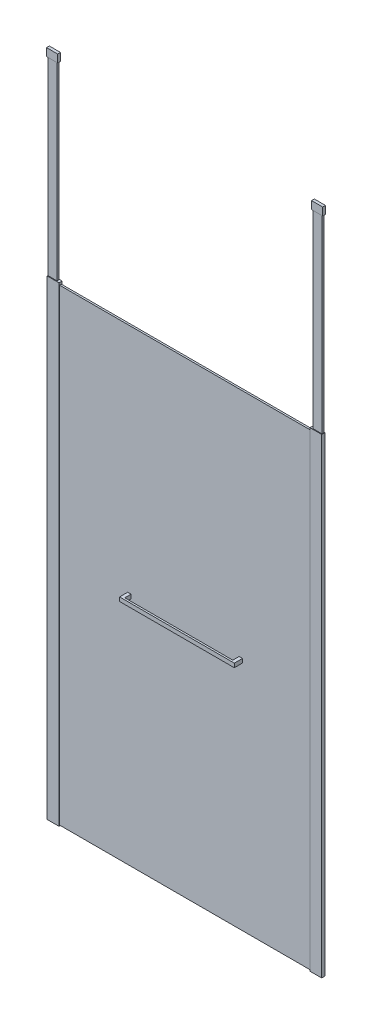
from build123d import *

# Parameters (mm, degrees)
DODANIE_WYCI_GNI_CIE1_START         = 3
DODANIE_WYCI_GNI_CIE1_DEPTH         = 2100
SZKIC2_W                            = 1147
SZKIC2_H                            = 8
DODANIE_WYCI_GNI_CIE2_DEPTH         = 2100
DODANIE_WYCI_GNI_CIE3_DEPTH         = 2108
SZKIC4_W                            = 53
SZKIC4_H                            = 14
DODANIE_WYCI_GNI_CIE4_DEPTH         = 11
SZKIC5_W                            = 53
SZKIC5_H                            = 14
DODANIE_WYCI_GNI_CIE5_DEPTH         = 3
SZKIC6_W                            = 8.1
SZKIC6_H                            = 7.8
DODANIE_WYCI_GNI_CIE6_DEPTH         = 15
SZKIC7_W                            = 53
SZKIC7_H                            = 14
DODANIE_WYCI_GNI_CIE7_DEPTH         = 3
SZKIC8_W                            = 53
SZKIC8_H                            = 14
DODANIE_WYCI_GNI_CIE8_DEPTH         = 3
SZKIC9_W                            = 40
SZKIC9_H                            = 8
DODANIE_WYCI_GNI_CIE9_DEPTH         = 883
DODANIE_WYCI_GNI_CIE9_2_DEPTH       = 883
DODANIE_WYCI_GNI_CIE10_START        = -32
SZKIC10_W                           = 50
SZKIC10_H                           = 12.5
DODANIE_WYCI_GNI_CIE10_DEPTH        = 35
DODANIE_WYCI_GNI_CIE11_DEPTH        = 36.5
DODANIE_WYCI_GNI_CIE11_DEPTH_BACK   = 18
SZKIC12_W                           = 15
SZKIC12_H                           = 18
DODANIE_WYCI_GNI_CIE11_2_DEPTH      = 36.5
DODANIE_WYCI_GNI_CIE11_2_DEPTH_BACK = 18
SZKIC13_W                           = 8
SZKIC13_H                           = 18
DODANIE_WYCI_GNI_CIE12_DEPTH        = 485


with BuildPart() as part:
    # Szkic1 → Dodanie-wyci_gni_cie1 (new body)
    with BuildSketch(Plane(origin=(0, 0, 0), x_dir=(1, 0, 0), z_dir=(0, 1, 0)).offset(DODANIE_WYCI_GNI_CIE1_START)):
        Polygon((0, 0), (0, 14), (53, 14), (53, 11), (42.9, 11), (42.9, 3), (53, 3), (53, 0), align=None)
    extrude(amount=DODANIE_WYCI_GNI_CIE1_DEPTH)

    # Szkic4 → Dodanie-wyci_gni_cie4 (add)
    with BuildSketch(Plane(origin=(0, 2103, 0), x_dir=(1, 0, 0), z_dir=(0, 1, 0))):
        with Locations((26.5, 7)):
            Rectangle(SZKIC4_W, SZKIC4_H)
    extrude(amount=DODANIE_WYCI_GNI_CIE4_DEPTH)

    # Szkic8 → Dodanie-wyci_gni_cie8 (add)
    with BuildSketch(Plane.XZ.offset(-3)):
        with Locations((26.5, -7)):
            Rectangle(SZKIC8_W, SZKIC8_H)
    extrude(amount=DODANIE_WYCI_GNI_CIE8_DEPTH)


with BuildPart() as body_2:
    # Szkic2 → Dodanie-wyci_gni_cie2 (new body)
    with BuildSketch(Plane.XZ.offset(-3)):
        with Locations((616.4, -7)):
            Rectangle(SZKIC2_W, SZKIC2_H)
    extrude(amount=-DODANIE_WYCI_GNI_CIE2_DEPTH)


with BuildPart() as body_3:
    # Szkic3 → Dodanie-wyci_gni_cie3 (new body)
    with BuildSketch(Plane.XZ.offset(-3)):
        Polygon((1179.8, -3), (1179.8, 0), (1232.8, 0), (1232.8, -14), (1179.8, -14), (1179.8, -11), (1189.9, -11), (1189.9, -3), align=None)
    extrude(amount=-DODANIE_WYCI_GNI_CIE3_DEPTH)

    # Szkic5 → Dodanie-wyci_gni_cie5 (add)
    with BuildSketch(Plane(origin=(0, 2111, 0), x_dir=(1, 0, 0), z_dir=(0, 1, 0))):
        with Locations((1206.3, 7)):
            Rectangle(SZKIC5_W, SZKIC5_H)
    extrude(amount=DODANIE_WYCI_GNI_CIE5_DEPTH)

    # Szkic6 → Dodanie-wyci_gni_cie6 (add)
    with BuildSketch(Plane.ZY.offset(-1179.8)):
        with Locations((-7, 2107.1)):
            Rectangle(SZKIC6_W, SZKIC6_H)
    extrude(amount=-DODANIE_WYCI_GNI_CIE6_DEPTH)

    # Szkic7 → Dodanie-wyci_gni_cie7 (add)
    with BuildSketch(Plane.XZ.offset(-3)):
        with Locations((1206.3, -7)):
            Rectangle(SZKIC7_W, SZKIC7_H)
    extrude(amount=DODANIE_WYCI_GNI_CIE7_DEPTH)


with BuildPart() as body_4:
    # Szkic9 → Dodanie-wyci_gni_cie9 (new body)
    with BuildSketch(Plane(origin=(0, 2114, 2099.6), x_dir=(-1, 0, 0), z_dir=(0, -1, 0))):
        with Locations((-1211.3, 2106.6)):
            Rectangle(SZKIC9_W, SZKIC9_H)
    extrude(amount=-DODANIE_WYCI_GNI_CIE9_DEPTH)

    # Szkic10 → Dodanie-wyci_gni_cie10 (add)
    with BuildSketch(Plane(origin=(0, 2997, 0), x_dir=(-1, 0, 0), z_dir=(0, 1, 0)).offset(DODANIE_WYCI_GNI_CIE10_START)):
        with Locations((-1211.3, -7)):
            Rectangle(SZKIC10_W, SZKIC10_H)
        with Locations((-21.5, -7)):
            Rectangle(SZKIC10_W, SZKIC10_H)
    extrude(amount=DODANIE_WYCI_GNI_CIE10_DEPTH)


with BuildPart() as body_5:
    # Szkic9 → Dodanie-wyci_gni_cie9 2 (new body)
    with BuildSketch(Plane(origin=(0, 2114, 2099.6), x_dir=(-1, 0, 0), z_dir=(0, -1, 0))):
        with Locations((-21.5, 2106.6)):
            Rectangle(SZKIC9_W, SZKIC9_H)
    extrude(amount=-DODANIE_WYCI_GNI_CIE9_2_DEPTH)


with BuildPart() as dodanie_wyci_gni_cie10_piece_1:
    # of the separate pieces the step leaves, piece 1, a body of its own (dodanie_wyci_gni_cie10_pieces)
    add(body_4.part.solids().sort_by_distance((1231.3, 2114, -11))[0])


with BuildPart() as dodanie_wyci_gni_cie10_piece_2:
    # of the separate pieces the step leaves, piece 2, a body of its own (dodanie_wyci_gni_cie10_pieces)
    add(body_4.part.solids().sort_by_distance((-3.5, 2965, -13.25))[0])


with BuildPart() as body_7:
    # Szkic12 → Dodanie-wyci_gni_cie11 (new, two sides: drawn at the far end of the back side and taken through both)
    with BuildSketch(Plane.XY.offset(-3).offset(-DODANIE_WYCI_GNI_CIE11_DEPTH_BACK)):
        with Locations((366.4, 1053)):
            Rectangle(SZKIC12_W, SZKIC12_H)
    extrude(amount=DODANIE_WYCI_GNI_CIE11_DEPTH + DODANIE_WYCI_GNI_CIE11_DEPTH_BACK)



with BuildPart() as body_8:
    # Szkic12 → Dodanie-wyci_gni_cie11 2 (new, two sides: drawn at the far end of the back side and taken through both)
    with BuildSketch(Plane.XY.offset(-3).offset(-DODANIE_WYCI_GNI_CIE11_2_DEPTH_BACK)):
        with Locations((866.4, 1053)):
            Rectangle(SZKIC12_W, SZKIC12_H)
    extrude(amount=DODANIE_WYCI_GNI_CIE11_2_DEPTH + DODANIE_WYCI_GNI_CIE11_2_DEPTH_BACK)


with BuildPart() as body_7_1:
    add(body_7.part)

    add(body_8.part)  # Dodanie-wyci_gni_cie12 merges body 8
    # Szkic13 → Dodanie-wyci_gni_cie12 (add)
    with BuildSketch(Plane(origin=(373.9, 0, 0), x_dir=(0, 0, -1), z_dir=(1, 0, 0))):
        with Locations((-29.5, 1053)):
            Rectangle(SZKIC13_W, SZKIC13_H)
    extrude(amount=DODANIE_WYCI_GNI_CIE12_DEPTH)


solid = Compound([part.part, body_2.part, body_3.part, body_5.part, dodanie_wyci_gni_cie10_piece_1.part, dodanie_wyci_gni_cie10_piece_2.part, body_7_1.part])
